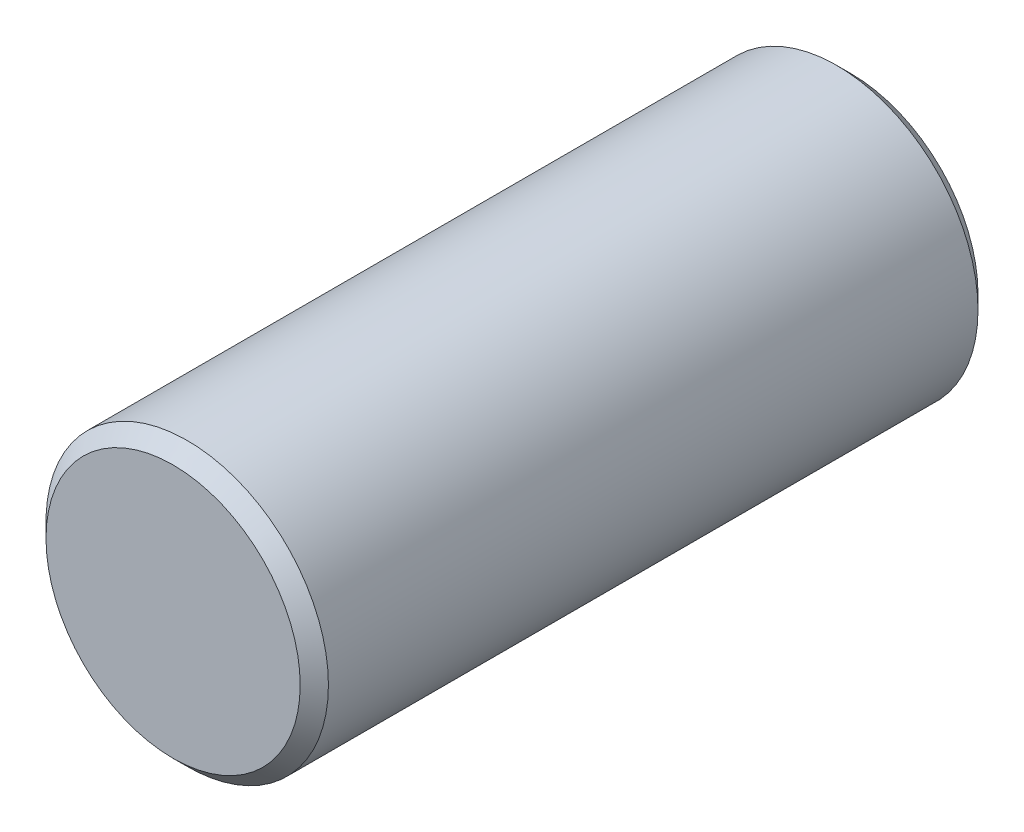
from build123d import *

# Parameters (mm, degrees)
ESQUISSE1_R        = 2.5
BOSS_EXTRU_1_DEPTH = 12
CHANFREIN1_SIZE    = 0.25


with BuildPart() as part:
    # Esquisse1 → Boss.-Extru.1 (new body)
    with BuildSketch(Plane.XY):
        Circle(ESQUISSE1_R)
    extrude(amount=BOSS_EXTRU_1_DEPTH)

    # Chanfrein1
    chanfrein1_edges = [part.edges().sort_by_distance(p)[0] for p in [
        (-2.5, 0, 0),
        (-2.5, 0, 12),
    ]]
    chamfer(chanfrein1_edges, length=CHANFREIN1_SIZE)


solid = part.part
